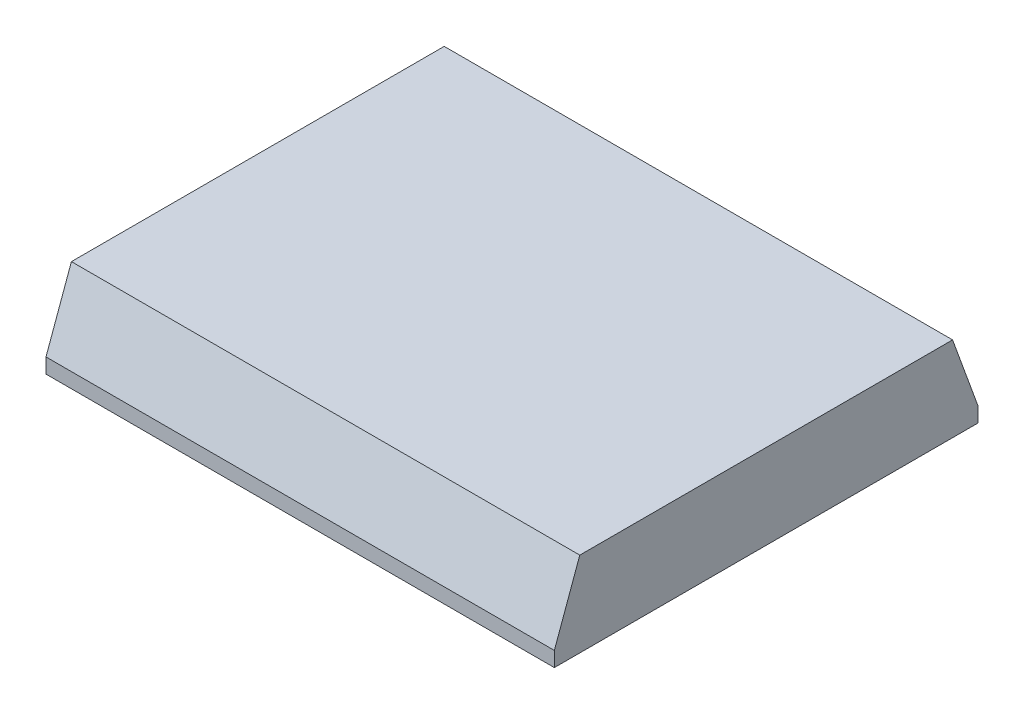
from build123d import *

# Parameters (mm, degrees)
SKETCH1_W           = 50
SKETCH1_H           = 10
BOSS_EXTRUDE1_DEPTH = 60
CHAMFER1_SIZE       = 3
CHAMFER1_SIZE2      = 8.242432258
CHAMFER2_SIZE       = 3
CHAMFER2_SIZE2      = 8.242432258


with BuildPart() as part:
    # Sketch1 → Boss-Extrude1 (new body)
    with BuildSketch(Plane(origin=(0, 0, 0), x_dir=(0, 0, -1), z_dir=(1, 0, 0))):
        Rectangle(SKETCH1_W, SKETCH1_H)
    extrude(amount=BOSS_EXTRUDE1_DEPTH)

    # Chamfer1
    chamfer1_edges = [part.edges().sort_by_distance(p)[0] for p in [
        (30, 5, 25),
    ]]
    chamfer1_side = [part.faces().sort_by_distance(p)[0] for p in [
        (30, 5, 0),
    ]]
    chamfer(chamfer1_edges, length=CHAMFER1_SIZE, length2=CHAMFER1_SIZE2, reference=chamfer1_side[0])

    # Chamfer2
    chamfer2_edges = [part.edges().sort_by_distance(p)[0] for p in [
        (30, 5, -25),
    ]]
    chamfer2_side = [part.faces().sort_by_distance(p)[0] for p in [
        (30, 5, -1.5),
    ]]
    chamfer(chamfer2_edges, length=CHAMFER2_SIZE, length2=CHAMFER2_SIZE2, reference=chamfer2_side[0])


solid = part.part
